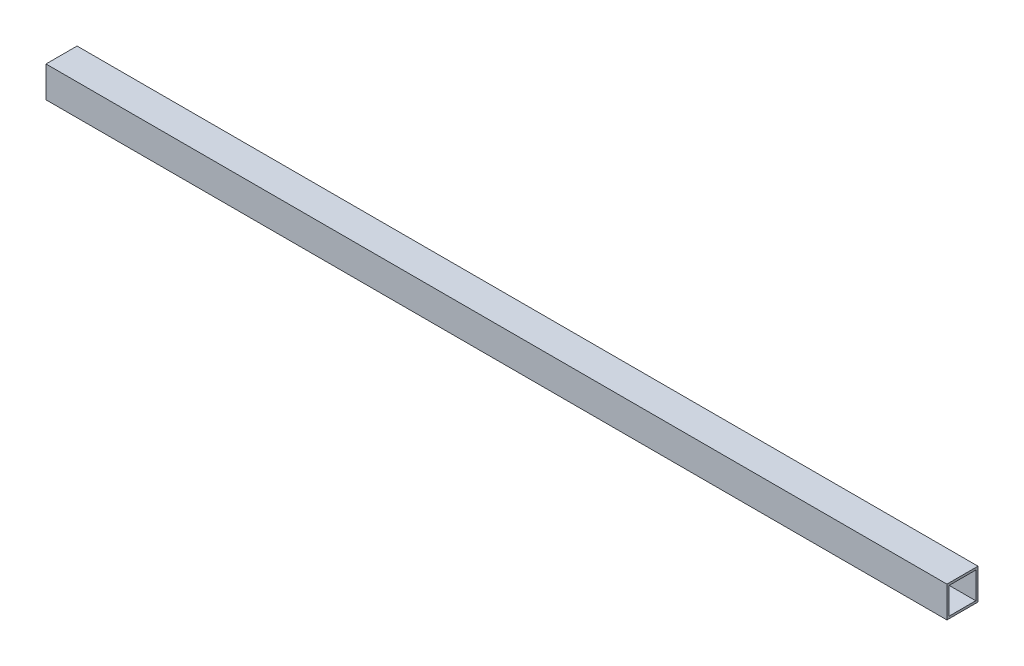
ISO-10303-21;
HEADER;
FILE_DESCRIPTION(('STEP AP214'),'2;1');
FILE_NAME('part.step','',(''),(''),'','','');
FILE_SCHEMA(('AUTOMOTIVE_DESIGN { 1 0 10303 214 1 1 1 1 }'));
ENDSEC;
DATA;
#1=APPLICATION_CONTEXT('core data for automotive mechanical design processes');
#2=APPLICATION_PROTOCOL_DEFINITION('international standard','automotive_design',2000,#1);
#3=PRODUCT_CONTEXT('',#1,'mechanical');
#4=PRODUCT('Part','Part','',(#3));
#5=PRODUCT_RELATED_PRODUCT_CATEGORY('part','',(#4));
#6=PRODUCT_DEFINITION_FORMATION('','',#4);
#7=PRODUCT_DEFINITION_CONTEXT('part definition',#1,'design');
#8=PRODUCT_DEFINITION('design','',#6,#7);
#9=PRODUCT_DEFINITION_SHAPE('','',#8);
#10=(LENGTH_UNIT() NAMED_UNIT(*) SI_UNIT(.MILLI.,.METRE.));
#11=(NAMED_UNIT(*) PLANE_ANGLE_UNIT() SI_UNIT($,.RADIAN.));
#12=(NAMED_UNIT(*) SI_UNIT($,.STERADIAN.) SOLID_ANGLE_UNIT());
#13=UNCERTAINTY_MEASURE_WITH_UNIT(LENGTH_MEASURE(1.E-05),#10,'distance_accuracy_value','');
#14=(GEOMETRIC_REPRESENTATION_CONTEXT(3) GLOBAL_UNCERTAINTY_ASSIGNED_CONTEXT((#13)) GLOBAL_UNIT_ASSIGNED_CONTEXT((#10,
#11,#12)) REPRESENTATION_CONTEXT('',''));
#15=CARTESIAN_POINT('',(0.,0.,0.));
#16=DIRECTION('',(0.,0.,1.));
#17=DIRECTION('',(1.,0.,0.));
#18=AXIS2_PLACEMENT_3D('',#15,#16,#17);
#19=CARTESIAN_POINT('',(1473.2,50.8,0.));
#20=DIRECTION('',(-1.,0.,0.));
#21=DIRECTION('',(0.,0.,1.));
#22=AXIS2_PLACEMENT_3D('',#19,#20,#21);
#23=PLANE('',#22);
#24=DIRECTION('',(0.,-1.,0.));
#25=VECTOR('',#24,1.);
#26=CARTESIAN_POINT('',(1473.2,0.,0.));
#27=LINE('',#26,#25);
#28=CARTESIAN_POINT('',(1473.2,50.8,0.));
#29=VERTEX_POINT('',#28);
#30=CARTESIAN_POINT('',(1473.2,0.,0.));
#31=VERTEX_POINT('',#30);
#32=EDGE_CURVE('E131',#29,#31,#27,.T.);
#33=ORIENTED_EDGE('',*,*,#32,.T.);
#34=DIRECTION('',(0.,0.,-1.));
#35=VECTOR('',#34,1.);
#36=CARTESIAN_POINT('',(1473.2,0.,0.));
#37=LINE('',#36,#35);
#38=CARTESIAN_POINT('',(1473.2,0.,-50.8));
#39=VERTEX_POINT('',#38);
#40=EDGE_CURVE('E134',#31,#39,#37,.T.);
#41=ORIENTED_EDGE('',*,*,#40,.T.);
#42=DIRECTION('',(0.,1.,0.));
#43=VECTOR('',#42,1.);
#44=CARTESIAN_POINT('',(1473.2,0.,-50.8));
#45=LINE('',#44,#43);
#46=CARTESIAN_POINT('',(1473.2,50.8,-50.8));
#47=VERTEX_POINT('',#46);
#48=EDGE_CURVE('E137',#39,#47,#45,.T.);
#49=ORIENTED_EDGE('',*,*,#48,.T.);
#50=DIRECTION('',(0.,0.,1.));
#51=VECTOR('',#50,1.);
#52=CARTESIAN_POINT('',(1473.2,50.8,0.));
#53=LINE('',#52,#51);
#54=EDGE_CURVE('E139',#47,#29,#53,.T.);
#55=ORIENTED_EDGE('',*,*,#54,.T.);
#56=EDGE_LOOP('',(#33,#41,#49,#55));
#57=FACE_BOUND('',#56,.T.);
#58=DIRECTION('',(0.,-1.,0.));
#59=VECTOR('',#58,1.);
#60=CARTESIAN_POINT('',(1473.2,47.1424,-3.6576));
#61=LINE('',#60,#59);
#62=CARTESIAN_POINT('',(1473.2,47.1424,-3.6576));
#63=VERTEX_POINT('',#62);
#64=CARTESIAN_POINT('',(1473.2,3.6576,-3.6576));
#65=VERTEX_POINT('',#64);
#66=EDGE_CURVE('E95',#63,#65,#61,.T.);
#67=ORIENTED_EDGE('',*,*,#66,.F.);
#68=DIRECTION('',(0.,0.,1.));
#69=VECTOR('',#68,1.);
#70=CARTESIAN_POINT('',(1473.2,47.1424,-3.6576));
#71=LINE('',#70,#69);
#72=CARTESIAN_POINT('',(1473.2,47.1424,-47.1424));
#73=VERTEX_POINT('',#72);
#74=EDGE_CURVE('E117',#73,#63,#71,.T.);
#75=ORIENTED_EDGE('',*,*,#74,.F.);
#76=DIRECTION('',(0.,1.,0.));
#77=VECTOR('',#76,1.);
#78=CARTESIAN_POINT('',(1473.2,47.1424,-47.1424));
#79=LINE('',#78,#77);
#80=CARTESIAN_POINT('',(1473.2,3.6576,-47.1424));
#81=VERTEX_POINT('',#80);
#82=EDGE_CURVE('E115',#81,#73,#79,.T.);
#83=ORIENTED_EDGE('',*,*,#82,.F.);
#84=DIRECTION('',(0.,0.,-1.));
#85=VECTOR('',#84,1.);
#86=CARTESIAN_POINT('',(1473.2,3.6576,-3.6576));
#87=LINE('',#86,#85);
#88=EDGE_CURVE('E103',#65,#81,#87,.T.);
#89=ORIENTED_EDGE('',*,*,#88,.F.);
#90=EDGE_LOOP('',(#67,#75,#83,#89));
#91=FACE_BOUND('',#90,.T.);
#92=ADVANCED_FACE('F30',(#57,#91),#23,.F.);
#93=CARTESIAN_POINT('',(0.,50.8,0.));
#94=DIRECTION('',(-1.,0.,0.));
#95=DIRECTION('',(0.,0.,1.));
#96=AXIS2_PLACEMENT_3D('',#93,#94,#95);
#97=PLANE('',#96);
#98=DIRECTION('',(0.,-1.,0.));
#99=VECTOR('',#98,1.);
#100=CARTESIAN_POINT('',(0.,0.,0.));
#101=LINE('',#100,#99);
#102=CARTESIAN_POINT('',(0.,50.8,0.));
#103=VERTEX_POINT('',#102);
#104=CARTESIAN_POINT('',(0.,0.,0.));
#105=VERTEX_POINT('',#104);
#106=EDGE_CURVE('E111',#103,#105,#101,.T.);
#107=ORIENTED_EDGE('',*,*,#106,.F.);
#108=DIRECTION('',(0.,0.,1.));
#109=VECTOR('',#108,1.);
#110=CARTESIAN_POINT('',(0.,50.8,0.));
#111=LINE('',#110,#109);
#112=CARTESIAN_POINT('',(0.,50.8,-50.8));
#113=VERTEX_POINT('',#112);
#114=EDGE_CURVE('E135',#113,#103,#111,.T.);
#115=ORIENTED_EDGE('',*,*,#114,.F.);
#116=DIRECTION('',(0.,1.,0.));
#117=VECTOR('',#116,1.);
#118=CARTESIAN_POINT('',(0.,0.,-50.8));
#119=LINE('',#118,#117);
#120=CARTESIAN_POINT('',(0.,0.,-50.8));
#121=VERTEX_POINT('',#120);
#122=EDGE_CURVE('E146',#121,#113,#119,.T.);
#123=ORIENTED_EDGE('',*,*,#122,.F.);
#124=DIRECTION('',(0.,0.,-1.));
#125=VECTOR('',#124,1.);
#126=CARTESIAN_POINT('',(0.,0.,0.));
#127=LINE('',#126,#125);
#128=EDGE_CURVE('E144',#105,#121,#127,.T.);
#129=ORIENTED_EDGE('',*,*,#128,.F.);
#130=EDGE_LOOP('',(#107,#115,#123,#129));
#131=FACE_BOUND('',#130,.T.);
#132=DIRECTION('',(0.,0.,1.));
#133=VECTOR('',#132,1.);
#134=CARTESIAN_POINT('',(0.,47.1424,-3.6576));
#135=LINE('',#134,#133);
#136=CARTESIAN_POINT('',(0.,47.1424,-47.1424));
#137=VERTEX_POINT('',#136);
#138=CARTESIAN_POINT('',(0.,47.1424,-3.6576));
#139=VERTEX_POINT('',#138);
#140=EDGE_CURVE('E104',#137,#139,#135,.T.);
#141=ORIENTED_EDGE('',*,*,#140,.T.);
#142=DIRECTION('',(0.,-1.,0.));
#143=VECTOR('',#142,1.);
#144=CARTESIAN_POINT('',(0.,47.1424,-3.6576));
#145=LINE('',#144,#143);
#146=CARTESIAN_POINT('',(0.,3.6576,-3.6576));
#147=VERTEX_POINT('',#146);
#148=EDGE_CURVE('E53',#139,#147,#145,.T.);
#149=ORIENTED_EDGE('',*,*,#148,.T.);
#150=DIRECTION('',(0.,0.,-1.));
#151=VECTOR('',#150,1.);
#152=CARTESIAN_POINT('',(0.,3.6576,-3.6576));
#153=LINE('',#152,#151);
#154=CARTESIAN_POINT('',(0.,3.6576,-47.1424));
#155=VERTEX_POINT('',#154);
#156=EDGE_CURVE('E110',#147,#155,#153,.T.);
#157=ORIENTED_EDGE('',*,*,#156,.T.);
#158=DIRECTION('',(0.,1.,0.));
#159=VECTOR('',#158,1.);
#160=CARTESIAN_POINT('',(0.,47.1424,-47.1424));
#161=LINE('',#160,#159);
#162=EDGE_CURVE('E123',#155,#137,#161,.T.);
#163=ORIENTED_EDGE('',*,*,#162,.T.);
#164=EDGE_LOOP('',(#141,#149,#157,#163));
#165=FACE_BOUND('',#164,.T.);
#166=ADVANCED_FACE('F164',(#131,#165),#97,.T.);
#167=CARTESIAN_POINT('',(1473.2,0.,0.));
#168=DIRECTION('',(0.,0.,-1.));
#169=DIRECTION('',(-1.,0.,0.));
#170=AXIS2_PLACEMENT_3D('',#167,#168,#169);
#171=PLANE('',#170);
#172=ORIENTED_EDGE('',*,*,#106,.T.);
#173=DIRECTION('',(-1.,0.,0.));
#174=VECTOR('',#173,1.);
#175=CARTESIAN_POINT('',(1473.2,0.,0.));
#176=LINE('',#175,#174);
#177=EDGE_CURVE('E11',#31,#105,#176,.T.);
#178=ORIENTED_EDGE('',*,*,#177,.F.);
#179=ORIENTED_EDGE('',*,*,#32,.F.);
#180=DIRECTION('',(-1.,0.,0.));
#181=VECTOR('',#180,1.);
#182=CARTESIAN_POINT('',(1473.2,50.8,0.));
#183=LINE('',#182,#181);
#184=EDGE_CURVE('E141',#29,#103,#183,.T.);
#185=ORIENTED_EDGE('',*,*,#184,.T.);
#186=EDGE_LOOP('',(#172,#178,#179,#185));
#187=FACE_BOUND('',#186,.T.);
#188=ADVANCED_FACE('F32',(#187),#171,.F.);
#189=CARTESIAN_POINT('',(1473.2,0.,0.));
#190=DIRECTION('',(0.,1.,0.));
#191=DIRECTION('',(0.,0.,1.));
#192=AXIS2_PLACEMENT_3D('',#189,#190,#191);
#193=PLANE('',#192);
#194=ORIENTED_EDGE('',*,*,#128,.T.);
#195=DIRECTION('',(-1.,0.,0.));
#196=VECTOR('',#195,1.);
#197=CARTESIAN_POINT('',(1473.2,0.,-50.8));
#198=LINE('',#197,#196);
#199=EDGE_CURVE('E38',#39,#121,#198,.T.);
#200=ORIENTED_EDGE('',*,*,#199,.F.);
#201=ORIENTED_EDGE('',*,*,#40,.F.);
#202=ORIENTED_EDGE('',*,*,#177,.T.);
#203=EDGE_LOOP('',(#194,#200,#201,#202));
#204=FACE_BOUND('',#203,.T.);
#205=ADVANCED_FACE('F174',(#204),#193,.F.);
#206=CARTESIAN_POINT('',(1473.2,0.,-50.8));
#207=DIRECTION('',(0.,0.,1.));
#208=DIRECTION('',(1.,0.,0.));
#209=AXIS2_PLACEMENT_3D('',#206,#207,#208);
#210=PLANE('',#209);
#211=ORIENTED_EDGE('',*,*,#122,.T.);
#212=DIRECTION('',(-1.,0.,0.));
#213=VECTOR('',#212,1.);
#214=CARTESIAN_POINT('',(1473.2,50.8,-50.8));
#215=LINE('',#214,#213);
#216=EDGE_CURVE('E151',#47,#113,#215,.T.);
#217=ORIENTED_EDGE('',*,*,#216,.F.);
#218=ORIENTED_EDGE('',*,*,#48,.F.);
#219=ORIENTED_EDGE('',*,*,#199,.T.);
#220=EDGE_LOOP('',(#211,#217,#218,#219));
#221=FACE_BOUND('',#220,.T.);
#222=ADVANCED_FACE('F158',(#221),#210,.F.);
#223=CARTESIAN_POINT('',(1473.2,50.8,0.));
#224=DIRECTION('',(0.,-1.,0.));
#225=DIRECTION('',(0.,0.,-1.));
#226=AXIS2_PLACEMENT_3D('',#223,#224,#225);
#227=PLANE('',#226);
#228=ORIENTED_EDGE('',*,*,#114,.T.);
#229=ORIENTED_EDGE('',*,*,#184,.F.);
#230=ORIENTED_EDGE('',*,*,#54,.F.);
#231=ORIENTED_EDGE('',*,*,#216,.T.);
#232=EDGE_LOOP('',(#228,#229,#230,#231));
#233=FACE_BOUND('',#232,.T.);
#234=ADVANCED_FACE('F168',(#233),#227,.F.);
#235=CARTESIAN_POINT('',(1473.2,47.1424,-3.6576));
#236=DIRECTION('',(0.,0.,-1.));
#237=DIRECTION('',(0.,1.,0.));
#238=AXIS2_PLACEMENT_3D('',#235,#236,#237);
#239=PLANE('',#238);
#240=ORIENTED_EDGE('',*,*,#148,.F.);
#241=DIRECTION('',(-1.,0.,0.));
#242=VECTOR('',#241,1.);
#243=CARTESIAN_POINT('',(1473.2,47.1424,-3.6576));
#244=LINE('',#243,#242);
#245=EDGE_CURVE('E99',#63,#139,#244,.T.);
#246=ORIENTED_EDGE('',*,*,#245,.F.);
#247=ORIENTED_EDGE('',*,*,#66,.T.);
#248=DIRECTION('',(-1.,0.,0.));
#249=VECTOR('',#248,1.);
#250=CARTESIAN_POINT('',(1473.2,3.6576,-3.6576));
#251=LINE('',#250,#249);
#252=EDGE_CURVE('E98',#65,#147,#251,.T.);
#253=ORIENTED_EDGE('',*,*,#252,.T.);
#254=EDGE_LOOP('',(#240,#246,#247,#253));
#255=FACE_BOUND('',#254,.T.);
#256=ADVANCED_FACE('F97',(#255),#239,.T.);
#257=CARTESIAN_POINT('',(1473.2,3.6576,-3.6576));
#258=DIRECTION('',(0.,1.,0.));
#259=DIRECTION('',(0.,0.,1.));
#260=AXIS2_PLACEMENT_3D('',#257,#258,#259);
#261=PLANE('',#260);
#262=ORIENTED_EDGE('',*,*,#156,.F.);
#263=ORIENTED_EDGE('',*,*,#252,.F.);
#264=ORIENTED_EDGE('',*,*,#88,.T.);
#265=DIRECTION('',(-1.,0.,0.));
#266=VECTOR('',#265,1.);
#267=CARTESIAN_POINT('',(1473.2,3.6576,-47.1424));
#268=LINE('',#267,#266);
#269=EDGE_CURVE('E112',#81,#155,#268,.T.);
#270=ORIENTED_EDGE('',*,*,#269,.T.);
#271=EDGE_LOOP('',(#262,#263,#264,#270));
#272=FACE_BOUND('',#271,.T.);
#273=ADVANCED_FACE('F107',(#272),#261,.T.);
#274=CARTESIAN_POINT('',(1473.2,47.1424,-47.1424));
#275=DIRECTION('',(0.,0.,1.));
#276=DIRECTION('',(0.,-1.,0.));
#277=AXIS2_PLACEMENT_3D('',#274,#275,#276);
#278=PLANE('',#277);
#279=ORIENTED_EDGE('',*,*,#162,.F.);
#280=ORIENTED_EDGE('',*,*,#269,.F.);
#281=ORIENTED_EDGE('',*,*,#82,.T.);
#282=DIRECTION('',(-1.,0.,0.));
#283=VECTOR('',#282,1.);
#284=CARTESIAN_POINT('',(1473.2,47.1424,-47.1424));
#285=LINE('',#284,#283);
#286=EDGE_CURVE('E45',#73,#137,#285,.T.);
#287=ORIENTED_EDGE('',*,*,#286,.T.);
#288=EDGE_LOOP('',(#279,#280,#281,#287));
#289=FACE_BOUND('',#288,.T.);
#290=ADVANCED_FACE('F197',(#289),#278,.T.);
#291=CARTESIAN_POINT('',(1473.2,47.1424,-3.6576));
#292=DIRECTION('',(0.,-1.,0.));
#293=DIRECTION('',(0.,0.,-1.));
#294=AXIS2_PLACEMENT_3D('',#291,#292,#293);
#295=PLANE('',#294);
#296=ORIENTED_EDGE('',*,*,#140,.F.);
#297=ORIENTED_EDGE('',*,*,#286,.F.);
#298=ORIENTED_EDGE('',*,*,#74,.T.);
#299=ORIENTED_EDGE('',*,*,#245,.T.);
#300=EDGE_LOOP('',(#296,#297,#298,#299));
#301=FACE_BOUND('',#300,.T.);
#302=ADVANCED_FACE('F201',(#301),#295,.T.);
#303=CLOSED_SHELL('',(#92,#166,#188,#205,#222,#234,#256,#273,#290,#302));
#304=MANIFOLD_SOLID_BREP('B2',#303);
#305=ADVANCED_BREP_SHAPE_REPRESENTATION('',(#18,#304),#14);
#306=SHAPE_DEFINITION_REPRESENTATION(#9,#305);
ENDSEC;
END-ISO-10303-21;
